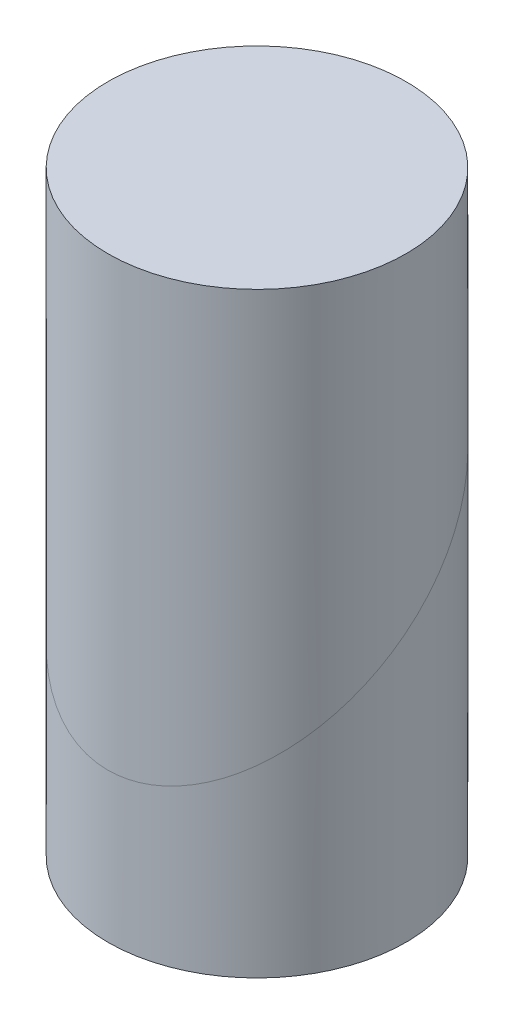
from build123d import *

# Parameters (mm, degrees)
SKIZZE1_R               = 25
LINEAR_AUSTRAGEN1_DEPTH = 100


with BuildPart() as part:
    # Skizze1 → Linear austragen1 (new body)
    with BuildSketch(Plane(origin=(0, 0, 0), x_dir=(1, 0, 0), z_dir=(0, 1, 0))):
        with Locations(Location((0, 0, 0), (0, 0, 270))):
            Circle(SKIZZE1_R)
    extrude(amount=LINEAR_AUSTRAGEN1_DEPTH)


solid = part.part
